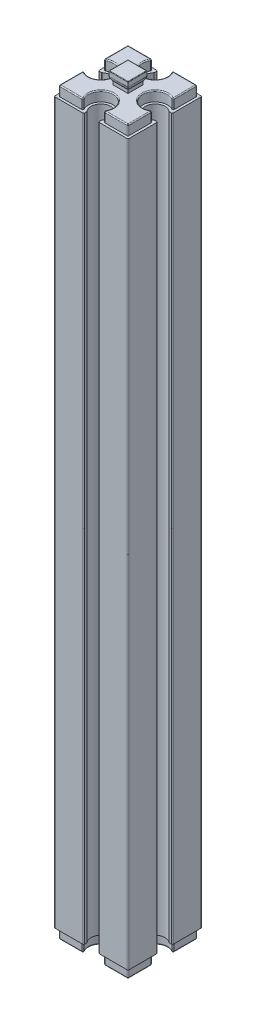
from build123d import *

# Parameters (mm, degrees)
EXTRUDE_1_DEPTH        = 73
EXTRUDE_2_DEPTH        = 2
EXTRUDE_3_DEPTH        = 2
FILLET_3_R             = 0.2
CUT_EXTRUDE_1_DEPTH    = 3
FILLET_4_R             = 0.2
FILLET_5_R             = 0.1
FILLET_3_OF_MIRROR_1_R = 0.2
FILLET_4_OF_MIRROR_1_R = 0.2
FILLET_5_OF_MIRROR_1_R = 0.1


with BuildPart() as part:
    # Sketch 1 → Extrude 1 (new body)
    with BuildSketch(Plane(origin=(0, 0, 0), x_dir=(1, 0, 0), z_dir=(0, 1, 0))):
        with BuildLine():
            Line((-7.5, 7.5), (-1.5, 7.5))
            Line((-1.5, 7.5), (-1.5, 6.822875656))
            ThreePointArc((-1.5, 6.822875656), (0, 3.5), (1.5, 6.822875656))
            Line((1.5, 6.822875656), (1.5, 7.5))
            Line((1.5, 7.5), (7.5, 7.5))
            Line((7.5, 7.5), (7.5, 1.5))
            Line((7.5, 1.5), (6.822875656, 1.5))
            ThreePointArc((6.822875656, 1.5), (3.5, 0), (6.822875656, -1.5))
            Line((6.822875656, -1.5), (7.5, -1.5))
            Line((7.5, -1.5), (7.5, -7.5))
            Line((7.5, -7.5), (1.5, -7.5))
            Line((1.5, -7.5), (1.5, -6.822875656))
            ThreePointArc((1.5, -6.822875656), (0, -3.5), (-1.5, -6.822875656))
            Line((-1.5, -6.822875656), (-1.5, -7.5))
            Line((-1.5, -7.5), (-7.5, -7.5))
            Line((-7.5, -7.5), (-7.5, -1.5))
            Line((-7.5, -1.5), (-6.822875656, -1.5))
            ThreePointArc((-6.822875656, -1.5), (-3.5, 0), (-6.822875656, 1.5))
            Line((-6.822875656, 1.5), (-7.5, 1.5))
            Line((-7.5, 1.5), (-7.5, 7.5))
        make_face()
    extrude_1 = extrude(amount=EXTRUDE_1_DEPTH)

    # Sketch 2 → Extrude 2 (add)
    with BuildSketch(Plane(origin=(0, 73, 0), x_dir=(1, 0, 0), z_dir=(0, 1, 0))):
        with BuildLine():
            Line((-7, 7), (-7, 2))
            ThreePointArc((-7, 2), (-3, 0), (-7, -2))
            Line((-7, -2), (-7, -7))
            Line((-7, -7), (-2, -7))
            ThreePointArc((-2, -7), (0, -3), (2, -7))
            Line((2, -7), (7, -7))
            Line((7, -7), (7, -2))
            ThreePointArc((7, -2), (3, 0), (7, 2))
            Line((7, 2), (7, 7))
            Line((7, 7), (2, 7))
            ThreePointArc((2, 7), (0, 3), (-2, 7))
            Line((-2, 7), (-7, 7))
        make_face()
    extrude_2 = extrude(amount=EXTRUDE_2_DEPTH)

    # Sketch 3 → Extrude 3 (add, symmetric)
    with BuildSketch(Plane(origin=(0, 0, 0), x_dir=(0, 0, -1), z_dir=(1, 0, 0))):
        with BuildLine():
            Line((-1.5, 75), (1.5, 75))
            Line((1.5, 75), (1.5, 75.677124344))
            ThreePointArc((1.5, 75.677124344), (1.780042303, 76.088161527), (1.95, 76.555590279))
            Line((1.95, 76.555590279), (1.95, 77.5))
            Line((1.95, 77.5), (-1.95, 77.5))
            Line((-1.95, 77.5), (-1.95, 76.555590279))
            ThreePointArc((-1.95, 76.555590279), (-1.780042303, 76.088161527), (-1.5, 75.677124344))
            Line((-1.5, 75.677124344), (-1.5, 75))
        make_face()
    extrude_3 = extrude(amount=EXTRUDE_3_DEPTH, both=True)

    # Fillet 3
    fillet_3_edges = [part.edges().sort_by_distance(p)[0] for p in [
        (-7.5, 36.5, -7.5),
        (-1.5, 36.5, -7.5),
        (1.5, 36.5, -7.5),
        (7.5, 36.5, -7.5),
        (7.5, 36.5, -1.5),
        (7.5, 36.5, 1.5),
        (7.5, 36.5, 7.5),
        (1.5, 36.5, 7.5),
        (-1.5, 36.5, 7.5),
        (-7.5, 36.5, 7.5),
        (-7.5, 36.5, 1.5),
        (-6.822875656, 36.5, -1.5),
        (-7.5, 36.5, -1.5),
    ]]
    fillet(fillet_3_edges, radius=FILLET_3_R)

    # Sketch 4 → Cut-Extrude 1 (cut, symmetric)
    with BuildSketch(Plane.XY):
        with BuildLine():
            Line((1.95, 77.5), (2, 77.5))
            Line((2, 77.5), (2, 75))
            Line((2, 75), (1.5, 75))
            Line((1.5, 75), (1.5, 75.677124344))
            ThreePointArc((1.5, 75.677124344), (1.780042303, 76.088161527), (1.95, 76.555590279))
            Line((1.95, 76.555590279), (1.95, 77.5))
        make_face()
        with BuildLine():
            Line((-1.95, 77.5), (-1.95, 76.555590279))
            ThreePointArc((-1.95, 76.555590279), (-1.780042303, 76.088161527), (-1.5, 75.677124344))
            Line((-1.5, 75.677124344), (-1.5, 75))
            Line((-1.5, 75), (-2, 75))
            Line((-2, 75), (-2, 77.5))
            Line((-2, 77.5), (-1.95, 77.5))
        make_face()
    cut_extrude_1 = extrude(amount=CUT_EXTRUDE_1_DEPTH, both=True, mode=Mode.SUBTRACT)

    # Fillet 4
    fillet_4_edges = [part.edges().sort_by_distance(p)[0] for p in [
        (-2, 74, -7),
        (-7, 74, -7),
        (-7, 74, -2),
        (-7, 74, 2),
        (-7, 74, 7),
        (-2, 74, 7),
        (2, 74, 7),
        (7, 74, 7),
        (7, 74, 2),
        (7, 74, -2),
        (7, 74, -7),
        (2, 74, -7),
        (-4.5, 75, -7),
        (-7, 75, -4.5),
        (-3, 75, 0),
        (-7, 75, 4.5),
        (-4.5, 75, 7),
        (0, 75, 3),
        (4.5, 75, 7),
        (7, 75, 4.5),
        (3, 75, 0),
        (7, 75, -4.5),
        (4.5, 75, -7),
        (0, 75, -3),
    ]]
    fillet(fillet_4_edges, radius=FILLET_4_R)

    # Fillet 5
    fillet_5_edges = [part.edges().sort_by_distance(p)[0] for p in [
        (1.95, 77.5, 0),
        (0, 77.5, -1.95),
        (0, 77.5, 1.95),
        (-1.95, 77.5, 0),
    ]]
    fillet(fillet_5_edges, radius=FILLET_5_R)


with BuildPart() as mirror_1_1:
    # Mirror 1: Extrude 1, Extrude 2, Extrude 3 across Top Plane
    add(extrude_1.mirror(Plane(origin=(0, 0, 0), x_dir=(1, 0, 0), z_dir=(0, 1, 0))))
    add(extrude_2.mirror(Plane(origin=(0, 0, 0), x_dir=(1, 0, 0), z_dir=(0, 1, 0))))
    add(extrude_3.mirror(Plane(origin=(0, 0, 0), x_dir=(1, 0, 0), z_dir=(0, 1, 0))))

    # Mirror 1 2: Cut-Extrude 1 across Top Plane
    add(cut_extrude_1.mirror(Plane(origin=(0, 0, 0), x_dir=(1, 0, 0), z_dir=(0, 1, 0))), mode=Mode.SUBTRACT)

    # Fillet 3 of Mirror 1
    fillet_3_of_mirror_1_edges = [mirror_1_1.edges().sort_by_distance(p)[0] for p in [
        (-7.5, -36.5, -7.5),
        (-1.5, -36.5, -7.5),
        (1.5, -36.5, -7.5),
        (7.5, -36.5, -7.5),
        (7.5, -36.5, -1.5),
        (7.5, -36.5, 1.5),
        (7.5, -36.5, 7.5),
        (1.5, -36.5, 7.5),
        (-1.5, -36.5, 7.5),
        (-7.5, -36.5, 7.5),
        (-7.5, -36.5, 1.5),
        (-6.822875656, -36.5, -1.5),
        (-7.5, -36.5, -1.5),
    ]]
    fillet(fillet_3_of_mirror_1_edges, radius=FILLET_3_OF_MIRROR_1_R)

    # Fillet 4 of Mirror 1
    fillet_4_of_mirror_1_edges = [mirror_1_1.edges().sort_by_distance(p)[0] for p in [
        (-2, -74, -7),
        (-7, -74, -7),
        (-7, -74, -2),
        (-7, -74, 2),
        (-7, -74, 7),
        (-2, -74, 7),
        (2, -74, 7),
        (7, -74, 7),
        (7, -74, 2),
        (7, -74, -2),
        (7, -74, -7),
        (2, -74, -7),
        (-4.5, -75, -7),
        (-7, -75, -4.5),
        (-3, -75, 0),
        (-7, -75, 4.5),
        (-4.5, -75, 7),
        (0, -75, 3),
        (4.5, -75, 7),
        (7, -75, 4.5),
        (3, -75, 0),
        (7, -75, -4.5),
        (4.5, -75, -7),
        (0, -75, -3),
    ]]
    fillet(fillet_4_of_mirror_1_edges, radius=FILLET_4_OF_MIRROR_1_R)

    # Fillet 5 of Mirror 1
    fillet_5_of_mirror_1_edges = [mirror_1_1.edges().sort_by_distance(p)[0] for p in [
        (1.95, -77.5, 0),
        (0, -77.5, -1.95),
        (0, -77.5, 1.95),
        (-1.95, -77.5, 0),
    ]]
    fillet(fillet_5_of_mirror_1_edges, radius=FILLET_5_OF_MIRROR_1_R)


with BuildPart() as part_1:
    add(part.part)

    # Mirror 1 united with what the copies tou: union Mirror 1_1
    add(mirror_1_1.part)


solid = part_1.part
